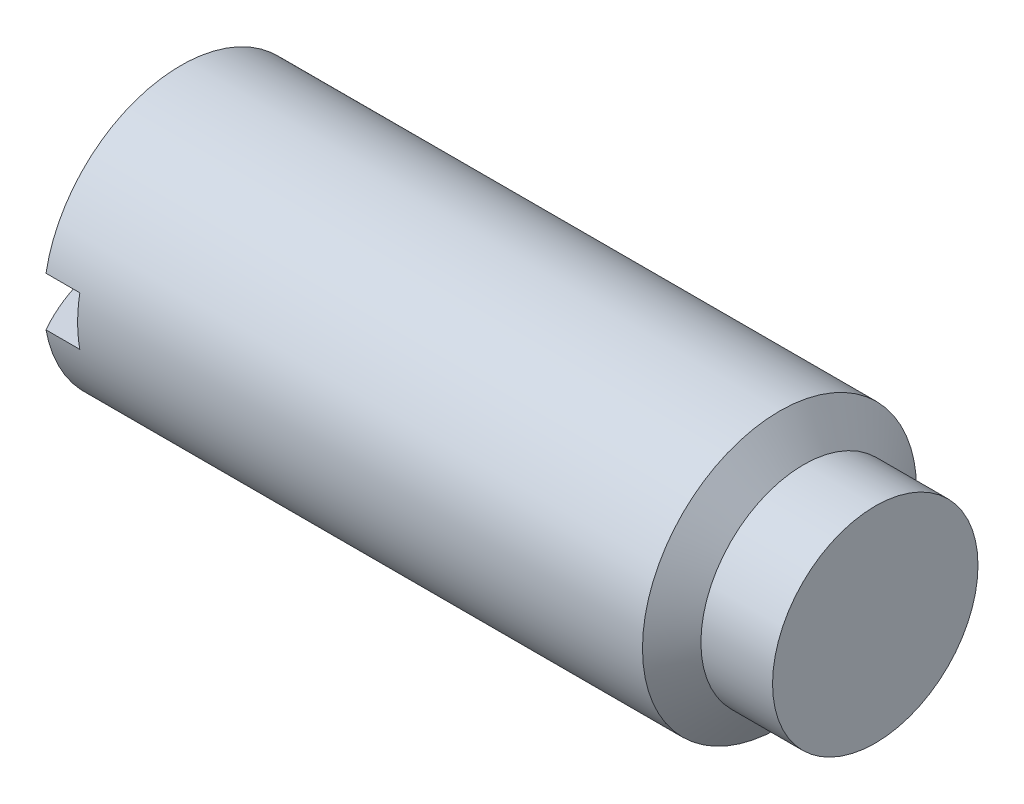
from build123d import *

# Parameters (mm, degrees)
SKETCH2_W  = 19.05
SKETCH2_H  = 3.4036
SLOT_DEPTH = 4.9022


with BuildPart() as part:
    # BodySke → BaseBody (revolve)
    with BuildSketch(Plane.XY, mode=Mode.PRIVATE) as basebody_sk:
        with BuildLine():
            Line((45.8216, 7.1374), (50.8, 7.1374))
            Line((50.8, 7.1374), (50.8, 0))
            Line((50.8, 0), (0, 0))
            ThreePointArc((0, 0), (0.649113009, 4.930502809), (2.552216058, 9.525))
            Line((2.552216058, 9.525), (44.149784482, 9.525))
            Line((44.149784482, 9.525), (45.8216, 7.1374))
        make_face()
    revolve(basebody_sk.sketch.rotate(Axis((-12.7, 0, 0), (1, 0, 0)), 90), axis=Axis((-12.7, 0, 0), (1, 0, 0)))

    # Sketch2 → Slot (cut)
    with BuildSketch(Plane(origin=(0, 0, 0), x_dir=(0, 0, -1), z_dir=(1, 0, 0))):
        Rectangle(SKETCH2_W, SKETCH2_H)
    extrude(amount=SLOT_DEPTH, mode=Mode.SUBTRACT)


solid = part.part
